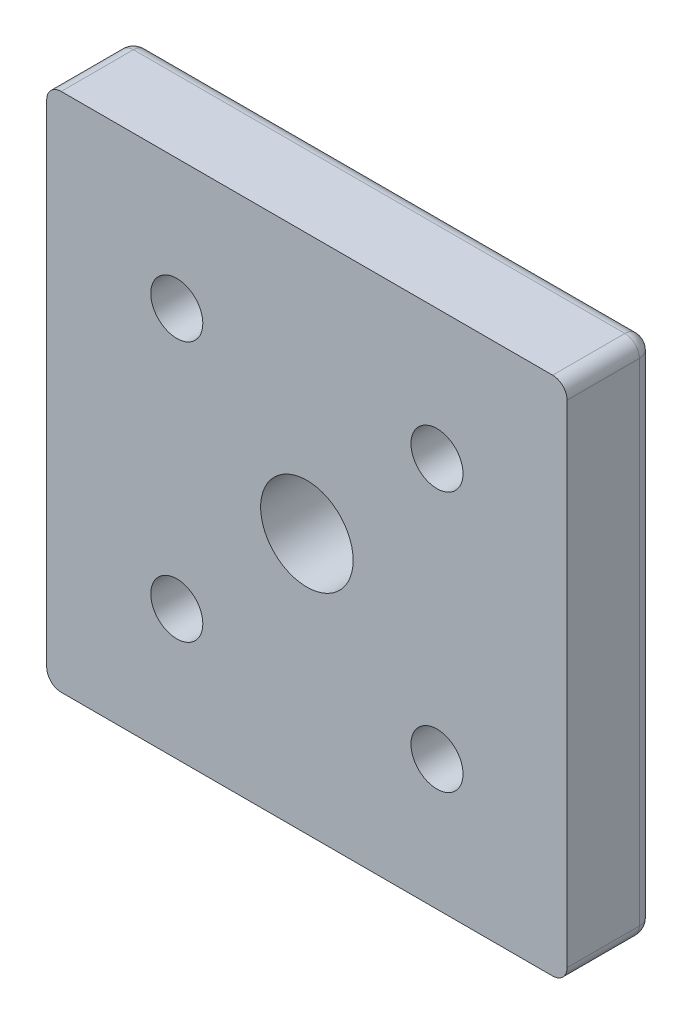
ISO-10303-21;
HEADER;
FILE_DESCRIPTION(('STEP AP214'),'2;1');
FILE_NAME('part.step','',(''),(''),'','','');
FILE_SCHEMA(('AUTOMOTIVE_DESIGN { 1 0 10303 214 1 1 1 1 }'));
ENDSEC;
DATA;
#1=APPLICATION_CONTEXT('core data for automotive mechanical design processes');
#2=APPLICATION_PROTOCOL_DEFINITION('international standard','automotive_design',2000,#1);
#3=PRODUCT_CONTEXT('',#1,'mechanical');
#4=PRODUCT('Part','Part','',(#3));
#5=PRODUCT_RELATED_PRODUCT_CATEGORY('part','',(#4));
#6=PRODUCT_DEFINITION_FORMATION('','',#4);
#7=PRODUCT_DEFINITION_CONTEXT('part definition',#1,'design');
#8=PRODUCT_DEFINITION('design','',#6,#7);
#9=PRODUCT_DEFINITION_SHAPE('','',#8);
#10=(LENGTH_UNIT() NAMED_UNIT(*) SI_UNIT(.MILLI.,.METRE.));
#11=(NAMED_UNIT(*) PLANE_ANGLE_UNIT() SI_UNIT($,.RADIAN.));
#12=(NAMED_UNIT(*) SI_UNIT($,.STERADIAN.) SOLID_ANGLE_UNIT());
#13=UNCERTAINTY_MEASURE_WITH_UNIT(LENGTH_MEASURE(1.E-05),#10,'distance_accuracy_value','');
#14=(GEOMETRIC_REPRESENTATION_CONTEXT(3) GLOBAL_UNCERTAINTY_ASSIGNED_CONTEXT((#13)) GLOBAL_UNIT_ASSIGNED_CONTEXT((#10,
#11,#12)) REPRESENTATION_CONTEXT('',''));
#15=CARTESIAN_POINT('',(0.,0.,0.));
#16=DIRECTION('',(0.,0.,1.));
#17=DIRECTION('',(1.,0.,0.));
#18=AXIS2_PLACEMENT_3D('',#15,#16,#17);
#19=CARTESIAN_POINT('',(22.5,-22.5,0.));
#20=DIRECTION('',(0.,0.,1.));
#21=DIRECTION('',(1.,0.,0.));
#22=AXIS2_PLACEMENT_3D('',#19,#20,#21);
#23=CYLINDRICAL_SURFACE('',#22,7.5);
#24=CARTESIAN_POINT('',(22.5,-22.5,5.5));
#25=DIRECTION('',(0.,0.,1.));
#26=DIRECTION('',(1.,0.,0.));
#27=AXIS2_PLACEMENT_3D('',#24,#25,#26);
#28=CIRCLE('',#27,7.5);
#29=CARTESIAN_POINT('',(30.,-22.5,5.5));
#30=VERTEX_POINT('',#29);
#31=EDGE_CURVE('E254',#30,#30,#28,.T.);
#32=ORIENTED_EDGE('',*,*,#31,.T.);
#33=EDGE_LOOP('',(#32));
#34=FACE_BOUND('',#33,.T.);
#35=CARTESIAN_POINT('',(22.5,-22.5,0.));
#36=DIRECTION('',(0.,0.,1.));
#37=DIRECTION('',(1.,0.,0.));
#38=AXIS2_PLACEMENT_3D('',#35,#36,#37);
#39=CIRCLE('',#38,7.5);
#40=CARTESIAN_POINT('',(30.,-22.5,0.));
#41=VERTEX_POINT('',#40);
#42=EDGE_CURVE('E19',#41,#41,#39,.F.);
#43=ORIENTED_EDGE('',*,*,#42,.T.);
#44=EDGE_LOOP('',(#43));
#45=FACE_BOUND('',#44,.T.);
#46=ADVANCED_FACE('F15',(#34,#45),#23,.F.);
#47=CARTESIAN_POINT('',(-22.5,-22.5,0.));
#48=DIRECTION('',(0.,0.,1.));
#49=DIRECTION('',(1.,0.,0.));
#50=AXIS2_PLACEMENT_3D('',#47,#48,#49);
#51=CYLINDRICAL_SURFACE('',#50,7.5);
#52=CARTESIAN_POINT('',(-22.5,-22.5,5.5));
#53=DIRECTION('',(0.,0.,1.));
#54=DIRECTION('',(1.,0.,0.));
#55=AXIS2_PLACEMENT_3D('',#52,#53,#54);
#56=CIRCLE('',#55,7.5);
#57=CARTESIAN_POINT('',(-15.,-22.5,5.5));
#58=VERTEX_POINT('',#57);
#59=EDGE_CURVE('E251',#58,#58,#56,.T.);
#60=ORIENTED_EDGE('',*,*,#59,.T.);
#61=EDGE_LOOP('',(#60));
#62=FACE_BOUND('',#61,.T.);
#63=CARTESIAN_POINT('',(-22.5,-22.5,0.));
#64=DIRECTION('',(0.,0.,1.));
#65=DIRECTION('',(1.,0.,0.));
#66=AXIS2_PLACEMENT_3D('',#63,#64,#65);
#67=CIRCLE('',#66,7.5);
#68=CARTESIAN_POINT('',(-15.,-22.5,0.));
#69=VERTEX_POINT('',#68);
#70=EDGE_CURVE('E260',#69,#69,#67,.F.);
#71=ORIENTED_EDGE('',*,*,#70,.T.);
#72=EDGE_LOOP('',(#71));
#73=FACE_BOUND('',#72,.T.);
#74=ADVANCED_FACE('F362',(#62,#73),#51,.F.);
#75=CARTESIAN_POINT('',(22.5,22.5,0.));
#76=DIRECTION('',(0.,0.,1.));
#77=DIRECTION('',(1.,0.,0.));
#78=AXIS2_PLACEMENT_3D('',#75,#76,#77);
#79=CYLINDRICAL_SURFACE('',#78,7.5);
#80=CARTESIAN_POINT('',(22.5,22.5,5.5));
#81=DIRECTION('',(0.,0.,1.));
#82=DIRECTION('',(1.,0.,0.));
#83=AXIS2_PLACEMENT_3D('',#80,#81,#82);
#84=CIRCLE('',#83,7.5);
#85=CARTESIAN_POINT('',(30.,22.5,5.5));
#86=VERTEX_POINT('',#85);
#87=EDGE_CURVE('E248',#86,#86,#84,.T.);
#88=ORIENTED_EDGE('',*,*,#87,.T.);
#89=EDGE_LOOP('',(#88));
#90=FACE_BOUND('',#89,.T.);
#91=CARTESIAN_POINT('',(22.5,22.5,0.));
#92=DIRECTION('',(0.,0.,1.));
#93=DIRECTION('',(1.,0.,0.));
#94=AXIS2_PLACEMENT_3D('',#91,#92,#93);
#95=CIRCLE('',#94,7.5);
#96=CARTESIAN_POINT('',(30.,22.5,0.));
#97=VERTEX_POINT('',#96);
#98=EDGE_CURVE('E262',#97,#97,#95,.F.);
#99=ORIENTED_EDGE('',*,*,#98,.T.);
#100=EDGE_LOOP('',(#99));
#101=FACE_BOUND('',#100,.T.);
#102=ADVANCED_FACE('F366',(#90,#101),#79,.F.);
#103=CARTESIAN_POINT('',(-22.5,22.5,0.));
#104=DIRECTION('',(0.,0.,1.));
#105=DIRECTION('',(1.,0.,0.));
#106=AXIS2_PLACEMENT_3D('',#103,#104,#105);
#107=CYLINDRICAL_SURFACE('',#106,7.5);
#108=CARTESIAN_POINT('',(-22.5,22.5,5.5));
#109=DIRECTION('',(0.,0.,1.));
#110=DIRECTION('',(1.,0.,0.));
#111=AXIS2_PLACEMENT_3D('',#108,#109,#110);
#112=CIRCLE('',#111,7.5);
#113=CARTESIAN_POINT('',(-15.,22.5,5.5));
#114=VERTEX_POINT('',#113);
#115=EDGE_CURVE('E121',#114,#114,#112,.T.);
#116=ORIENTED_EDGE('',*,*,#115,.T.);
#117=EDGE_LOOP('',(#116));
#118=FACE_BOUND('',#117,.T.);
#119=CARTESIAN_POINT('',(-22.5,22.5,0.));
#120=DIRECTION('',(0.,0.,1.));
#121=DIRECTION('',(1.,0.,0.));
#122=AXIS2_PLACEMENT_3D('',#119,#120,#121);
#123=CIRCLE('',#122,7.5);
#124=CARTESIAN_POINT('',(-15.,22.5,0.));
#125=VERTEX_POINT('',#124);
#126=EDGE_CURVE('E257',#125,#125,#123,.F.);
#127=ORIENTED_EDGE('',*,*,#126,.T.);
#128=EDGE_LOOP('',(#127));
#129=FACE_BOUND('',#128,.T.);
#130=ADVANCED_FACE('F194',(#118,#129),#107,.F.);
#131=CARTESIAN_POINT('',(42.5,42.5,2.5));
#132=DIRECTION('',(1.,0.,0.));
#133=DIRECTION('',(0.,1.,0.));
#134=AXIS2_PLACEMENT_3D('',#131,#132,#133);
#135=SPHERICAL_SURFACE('',#134,2.5);
#136=CARTESIAN_POINT('',(42.5,42.5,2.5));
#137=DIRECTION('',(0.,0.,1.));
#138=DIRECTION('',(1.,0.,0.));
#139=AXIS2_PLACEMENT_3D('',#136,#137,#138);
#140=CIRCLE('',#139,2.5);
#141=CARTESIAN_POINT('',(45.,42.5,2.5));
#142=VERTEX_POINT('',#141);
#143=CARTESIAN_POINT('',(42.5,45.,2.5));
#144=VERTEX_POINT('',#143);
#145=EDGE_CURVE('E67',#142,#144,#140,.T.);
#146=ORIENTED_EDGE('',*,*,#145,.F.);
#147=CARTESIAN_POINT('',(42.5,42.5,2.5));
#148=DIRECTION('',(0.,1.,0.));
#149=DIRECTION('',(0.,0.,1.));
#150=AXIS2_PLACEMENT_3D('',#147,#148,#149);
#151=CIRCLE('',#150,2.5);
#152=CARTESIAN_POINT('',(42.5,42.5000000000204,0.));
#153=VERTEX_POINT('',#152);
#154=EDGE_CURVE('E102',#153,#142,#151,.F.);
#155=ORIENTED_EDGE('',*,*,#154,.F.);
#156=CARTESIAN_POINT('',(42.5,42.5,2.5));
#157=DIRECTION('',(-1.,0.,0.));
#158=DIRECTION('',(0.,0.,1.));
#159=AXIS2_PLACEMENT_3D('',#156,#157,#158);
#160=CIRCLE('',#159,2.5);
#161=EDGE_CURVE('E99',#144,#153,#160,.T.);
#162=ORIENTED_EDGE('',*,*,#161,.F.);
#163=EDGE_LOOP('',(#146,#155,#162));
#164=FACE_BOUND('',#163,.T.);
#165=ADVANCED_FACE('F101',(#164),#135,.T.);
#166=CARTESIAN_POINT('',(-22.5,42.5,2.5));
#167=DIRECTION('',(-1.,0.,0.));
#168=DIRECTION('',(0.,0.,1.));
#169=AXIS2_PLACEMENT_3D('',#166,#167,#168);
#170=CYLINDRICAL_SURFACE('',#169,2.5);
#171=CARTESIAN_POINT('',(-42.5,42.5,2.5));
#172=DIRECTION('',(1.,0.,0.));
#173=DIRECTION('',(0.,1.,0.));
#174=AXIS2_PLACEMENT_3D('',#171,#172,#173);
#175=CIRCLE('',#174,2.5);
#176=CARTESIAN_POINT('',(-42.5,45.,2.5));
#177=VERTEX_POINT('',#176);
#178=CARTESIAN_POINT('',(-42.5,42.5,0.));
#179=VERTEX_POINT('',#178);
#180=EDGE_CURVE('E106',#177,#179,#175,.F.);
#181=ORIENTED_EDGE('',*,*,#180,.F.);
#182=DIRECTION('',(1.,0.,0.));
#183=VECTOR('',#182,1.);
#184=CARTESIAN_POINT('',(-45.,45.,2.5));
#185=LINE('',#184,#183);
#186=EDGE_CURVE('E109',#144,#177,#185,.F.);
#187=ORIENTED_EDGE('',*,*,#186,.F.);
#188=ORIENTED_EDGE('',*,*,#161,.T.);
#189=DIRECTION('',(1.,0.,0.));
#190=VECTOR('',#189,1.);
#191=CARTESIAN_POINT('',(0.,42.5,0.));
#192=LINE('',#191,#190);
#193=EDGE_CURVE('E145',#153,#179,#192,.F.);
#194=ORIENTED_EDGE('',*,*,#193,.T.);
#195=EDGE_LOOP('',(#181,#187,#188,#194));
#196=FACE_BOUND('',#195,.T.);
#197=ADVANCED_FACE('F110',(#196),#170,.T.);
#198=CARTESIAN_POINT('',(-42.5,42.5,2.5));
#199=DIRECTION('',(1.,0.,0.));
#200=DIRECTION('',(0.,1.,0.));
#201=AXIS2_PLACEMENT_3D('',#198,#199,#200);
#202=SPHERICAL_SURFACE('',#201,2.5);
#203=CARTESIAN_POINT('',(-42.5,42.5,2.5));
#204=DIRECTION('',(0.,0.,1.));
#205=DIRECTION('',(1.,0.,0.));
#206=AXIS2_PLACEMENT_3D('',#203,#204,#205);
#207=CIRCLE('',#206,2.5);
#208=CARTESIAN_POINT('',(-45.,42.5,2.5));
#209=VERTEX_POINT('',#208);
#210=EDGE_CURVE('E126',#177,#209,#207,.T.);
#211=ORIENTED_EDGE('',*,*,#210,.F.);
#212=ORIENTED_EDGE('',*,*,#180,.T.);
#213=CARTESIAN_POINT('',(-42.5,42.5,2.5));
#214=DIRECTION('',(0.,-1.,0.));
#215=DIRECTION('',(0.,0.,-1.));
#216=AXIS2_PLACEMENT_3D('',#213,#214,#215);
#217=CIRCLE('',#216,2.5);
#218=EDGE_CURVE('E179',#209,#179,#217,.T.);
#219=ORIENTED_EDGE('',*,*,#218,.F.);
#220=EDGE_LOOP('',(#211,#212,#219));
#221=FACE_BOUND('',#220,.T.);
#222=ADVANCED_FACE('F185',(#221),#202,.T.);
#223=CARTESIAN_POINT('',(-42.5,-22.5,2.5));
#224=DIRECTION('',(0.,-1.,0.));
#225=DIRECTION('',(0.,0.,-1.));
#226=AXIS2_PLACEMENT_3D('',#223,#224,#225);
#227=CYLINDRICAL_SURFACE('',#226,2.5);
#228=CARTESIAN_POINT('',(-42.5,-42.5,2.5));
#229=DIRECTION('',(0.,1.,-9.81305763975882E-11));
#230=DIRECTION('',(1.,0.,0.));
#231=AXIS2_PLACEMENT_3D('',#228,#229,#230);
#232=CIRCLE('',#231,2.5);
#233=CARTESIAN_POINT('',(-45.,-42.5,2.5));
#234=VERTEX_POINT('',#233);
#235=CARTESIAN_POINT('',(-42.5,-42.5000000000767,0.));
#236=VERTEX_POINT('',#235);
#237=EDGE_CURVE('E177',#234,#236,#232,.F.);
#238=ORIENTED_EDGE('',*,*,#237,.F.);
#239=DIRECTION('',(0.,1.,0.));
#240=VECTOR('',#239,1.);
#241=CARTESIAN_POINT('',(-45.,-45.,2.5));
#242=LINE('',#241,#240);
#243=EDGE_CURVE('E175',#209,#234,#242,.F.);
#244=ORIENTED_EDGE('',*,*,#243,.F.);
#245=ORIENTED_EDGE('',*,*,#218,.T.);
#246=DIRECTION('',(0.,1.,0.));
#247=VECTOR('',#246,1.);
#248=CARTESIAN_POINT('',(-42.5,0.,0.));
#249=LINE('',#248,#247);
#250=EDGE_CURVE('E202',#179,#236,#249,.F.);
#251=ORIENTED_EDGE('',*,*,#250,.T.);
#252=EDGE_LOOP('',(#238,#244,#245,#251));
#253=FACE_BOUND('',#252,.T.);
#254=ADVANCED_FACE('F169',(#253),#227,.T.);
#255=CARTESIAN_POINT('',(-42.5,-42.5,2.5));
#256=DIRECTION('',(1.,0.,0.));
#257=DIRECTION('',(0.,1.,0.));
#258=AXIS2_PLACEMENT_3D('',#255,#256,#257);
#259=SPHERICAL_SURFACE('',#258,2.5);
#260=CARTESIAN_POINT('',(-42.5,-42.5,2.5));
#261=DIRECTION('',(0.,0.,1.));
#262=DIRECTION('',(1.,0.,0.));
#263=AXIS2_PLACEMENT_3D('',#260,#261,#262);
#264=CIRCLE('',#263,2.5);
#265=CARTESIAN_POINT('',(-42.5,-45.,2.5));
#266=VERTEX_POINT('',#265);
#267=EDGE_CURVE('E286',#234,#266,#264,.T.);
#268=ORIENTED_EDGE('',*,*,#267,.F.);
#269=ORIENTED_EDGE('',*,*,#237,.T.);
#270=CARTESIAN_POINT('',(-42.5,-42.5,2.5));
#271=DIRECTION('',(1.,0.,0.));
#272=DIRECTION('',(0.,0.,-1.));
#273=AXIS2_PLACEMENT_3D('',#270,#271,#272);
#274=CIRCLE('',#273,2.5);
#275=EDGE_CURVE('E178',#266,#236,#274,.T.);
#276=ORIENTED_EDGE('',*,*,#275,.F.);
#277=EDGE_LOOP('',(#268,#269,#276));
#278=FACE_BOUND('',#277,.T.);
#279=ADVANCED_FACE('F164',(#278),#259,.T.);
#280=CARTESIAN_POINT('',(22.5,-42.5,2.5));
#281=DIRECTION('',(1.,0.,0.));
#282=DIRECTION('',(0.,0.,-1.));
#283=AXIS2_PLACEMENT_3D('',#280,#281,#282);
#284=CYLINDRICAL_SURFACE('',#283,2.5);
#285=CARTESIAN_POINT('',(42.5,-42.5,2.5));
#286=DIRECTION('',(1.,0.,0.));
#287=DIRECTION('',(0.,1.,0.));
#288=AXIS2_PLACEMENT_3D('',#285,#286,#287);
#289=CIRCLE('',#288,2.5);
#290=CARTESIAN_POINT('',(42.5,-45.,2.50000000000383));
#291=VERTEX_POINT('',#290);
#292=CARTESIAN_POINT('',(42.5,-42.5,0.));
#293=VERTEX_POINT('',#292);
#294=EDGE_CURVE('E143',#291,#293,#289,.T.);
#295=ORIENTED_EDGE('',*,*,#294,.F.);
#296=DIRECTION('',(1.,0.,0.));
#297=VECTOR('',#296,1.);
#298=CARTESIAN_POINT('',(45.,-45.,2.5));
#299=LINE('',#298,#297);
#300=EDGE_CURVE('E146',#266,#291,#299,.T.);
#301=ORIENTED_EDGE('',*,*,#300,.F.);
#302=ORIENTED_EDGE('',*,*,#275,.T.);
#303=DIRECTION('',(1.,0.,0.));
#304=VECTOR('',#303,1.);
#305=CARTESIAN_POINT('',(0.,-42.5,0.));
#306=LINE('',#305,#304);
#307=EDGE_CURVE('E200',#236,#293,#306,.T.);
#308=ORIENTED_EDGE('',*,*,#307,.T.);
#309=EDGE_LOOP('',(#295,#301,#302,#308));
#310=FACE_BOUND('',#309,.T.);
#311=ADVANCED_FACE('F159',(#310),#284,.T.);
#312=CARTESIAN_POINT('',(42.5,-42.5,2.5));
#313=DIRECTION('',(1.,0.,0.));
#314=DIRECTION('',(0.,1.,0.));
#315=AXIS2_PLACEMENT_3D('',#312,#313,#314);
#316=SPHERICAL_SURFACE('',#315,2.5);
#317=CARTESIAN_POINT('',(42.5,-42.5,2.5));
#318=DIRECTION('',(0.,0.,1.));
#319=DIRECTION('',(1.,0.,0.));
#320=AXIS2_PLACEMENT_3D('',#317,#318,#319);
#321=CIRCLE('',#320,2.5);
#322=CARTESIAN_POINT('',(45.,-42.5,2.5));
#323=VERTEX_POINT('',#322);
#324=EDGE_CURVE('E134',#291,#323,#321,.T.);
#325=ORIENTED_EDGE('',*,*,#324,.F.);
#326=ORIENTED_EDGE('',*,*,#294,.T.);
#327=CARTESIAN_POINT('',(42.5,-42.5,2.5));
#328=DIRECTION('',(0.,1.,0.));
#329=DIRECTION('',(0.,0.,1.));
#330=AXIS2_PLACEMENT_3D('',#327,#328,#329);
#331=CIRCLE('',#330,2.5);
#332=EDGE_CURVE('E140',#323,#293,#331,.T.);
#333=ORIENTED_EDGE('',*,*,#332,.F.);
#334=EDGE_LOOP('',(#325,#326,#333));
#335=FACE_BOUND('',#334,.T.);
#336=ADVANCED_FACE('F154',(#335),#316,.T.);
#337=CARTESIAN_POINT('',(42.5,22.5,2.5));
#338=DIRECTION('',(0.,1.,0.));
#339=DIRECTION('',(0.,0.,1.));
#340=AXIS2_PLACEMENT_3D('',#337,#338,#339);
#341=CYLINDRICAL_SURFACE('',#340,2.5);
#342=ORIENTED_EDGE('',*,*,#154,.T.);
#343=DIRECTION('',(0.,1.,0.));
#344=VECTOR('',#343,1.);
#345=CARTESIAN_POINT('',(45.,45.,2.5));
#346=LINE('',#345,#344);
#347=EDGE_CURVE('E138',#323,#142,#346,.T.);
#348=ORIENTED_EDGE('',*,*,#347,.F.);
#349=ORIENTED_EDGE('',*,*,#332,.T.);
#350=DIRECTION('',(0.,1.,0.));
#351=VECTOR('',#350,1.);
#352=CARTESIAN_POINT('',(42.5,0.,0.));
#353=LINE('',#352,#351);
#354=EDGE_CURVE('E198',#293,#153,#353,.T.);
#355=ORIENTED_EDGE('',*,*,#354,.T.);
#356=EDGE_LOOP('',(#342,#348,#349,#355));
#357=FACE_BOUND('',#356,.T.);
#358=ADVANCED_FACE('F158',(#357),#341,.T.);
#359=CARTESIAN_POINT('',(0.,0.,0.));
#360=DIRECTION('',(0.,0.,1.));
#361=DIRECTION('',(1.,0.,0.));
#362=AXIS2_PLACEMENT_3D('',#359,#360,#361);
#363=PLANE('',#362);
#364=ORIENTED_EDGE('',*,*,#126,.F.);
#365=EDGE_LOOP('',(#364));
#366=FACE_BOUND('',#365,.T.);
#367=ORIENTED_EDGE('',*,*,#70,.F.);
#368=EDGE_LOOP('',(#367));
#369=FACE_BOUND('',#368,.T.);
#370=ORIENTED_EDGE('',*,*,#98,.F.);
#371=EDGE_LOOP('',(#370));
#372=FACE_BOUND('',#371,.T.);
#373=ORIENTED_EDGE('',*,*,#42,.F.);
#374=EDGE_LOOP('',(#373));
#375=FACE_BOUND('',#374,.T.);
#376=CARTESIAN_POINT('',(0.,0.,0.));
#377=DIRECTION('',(0.,0.,1.));
#378=DIRECTION('',(1.,0.,0.));
#379=AXIS2_PLACEMENT_3D('',#376,#377,#378);
#380=CIRCLE('',#379,8.);
#381=CARTESIAN_POINT('',(8.,0.,0.));
#382=VERTEX_POINT('',#381);
#383=EDGE_CURVE('E243',#382,#382,#380,.T.);
#384=ORIENTED_EDGE('',*,*,#383,.T.);
#385=EDGE_LOOP('',(#384));
#386=FACE_BOUND('',#385,.T.);
#387=ORIENTED_EDGE('',*,*,#307,.F.);
#388=ORIENTED_EDGE('',*,*,#250,.F.);
#389=ORIENTED_EDGE('',*,*,#193,.F.);
#390=ORIENTED_EDGE('',*,*,#354,.F.);
#391=EDGE_LOOP('',(#387,#388,#389,#390));
#392=FACE_BOUND('',#391,.T.);
#393=ADVANCED_FACE('F270',(#366,#369,#372,#375,#386,#392),#363,.F.);
#394=CARTESIAN_POINT('',(30.15,-14.85,5.5));
#395=DIRECTION('',(0.,0.,1.));
#396=DIRECTION('',(-1.,0.,0.));
#397=AXIS2_PLACEMENT_3D('',#394,#395,#396);
#398=PLANE('',#397);
#399=CARTESIAN_POINT('',(22.5,-22.5,5.5));
#400=DIRECTION('',(0.,0.,1.));
#401=DIRECTION('',(1.,0.,0.));
#402=AXIS2_PLACEMENT_3D('',#399,#400,#401);
#403=CIRCLE('',#402,4.5);
#404=CARTESIAN_POINT('',(27.,-22.5,5.5));
#405=VERTEX_POINT('',#404);
#406=EDGE_CURVE('E240',#405,#405,#403,.T.);
#407=ORIENTED_EDGE('',*,*,#406,.T.);
#408=EDGE_LOOP('',(#407));
#409=FACE_BOUND('',#408,.T.);
#410=ORIENTED_EDGE('',*,*,#31,.F.);
#411=EDGE_LOOP('',(#410));
#412=FACE_BOUND('',#411,.T.);
#413=ADVANCED_FACE('F273',(#409,#412),#398,.F.);
#414=CARTESIAN_POINT('',(-14.85,-14.85,5.5));
#415=DIRECTION('',(0.,0.,1.));
#416=DIRECTION('',(-1.,0.,0.));
#417=AXIS2_PLACEMENT_3D('',#414,#415,#416);
#418=PLANE('',#417);
#419=CARTESIAN_POINT('',(-22.5,-22.5,5.5));
#420=DIRECTION('',(0.,0.,1.));
#421=DIRECTION('',(1.,0.,0.));
#422=AXIS2_PLACEMENT_3D('',#419,#420,#421);
#423=CIRCLE('',#422,4.5);
#424=CARTESIAN_POINT('',(-18.,-22.5,5.5));
#425=VERTEX_POINT('',#424);
#426=EDGE_CURVE('E237',#425,#425,#423,.T.);
#427=ORIENTED_EDGE('',*,*,#426,.T.);
#428=EDGE_LOOP('',(#427));
#429=FACE_BOUND('',#428,.T.);
#430=ORIENTED_EDGE('',*,*,#59,.F.);
#431=EDGE_LOOP('',(#430));
#432=FACE_BOUND('',#431,.T.);
#433=ADVANCED_FACE('F357',(#429,#432),#418,.F.);
#434=CARTESIAN_POINT('',(30.15,30.15,5.5));
#435=DIRECTION('',(0.,0.,1.));
#436=DIRECTION('',(-1.,0.,0.));
#437=AXIS2_PLACEMENT_3D('',#434,#435,#436);
#438=PLANE('',#437);
#439=CARTESIAN_POINT('',(22.5,22.5,5.5));
#440=DIRECTION('',(0.,0.,1.));
#441=DIRECTION('',(1.,0.,0.));
#442=AXIS2_PLACEMENT_3D('',#439,#440,#441);
#443=CIRCLE('',#442,4.5);
#444=CARTESIAN_POINT('',(27.,22.5,5.5));
#445=VERTEX_POINT('',#444);
#446=EDGE_CURVE('E234',#445,#445,#443,.T.);
#447=ORIENTED_EDGE('',*,*,#446,.T.);
#448=EDGE_LOOP('',(#447));
#449=FACE_BOUND('',#448,.T.);
#450=ORIENTED_EDGE('',*,*,#87,.F.);
#451=EDGE_LOOP('',(#450));
#452=FACE_BOUND('',#451,.T.);
#453=ADVANCED_FACE('F379',(#449,#452),#438,.F.);
#454=CARTESIAN_POINT('',(-14.85,30.15,5.5));
#455=DIRECTION('',(0.,0.,1.));
#456=DIRECTION('',(-1.,0.,0.));
#457=AXIS2_PLACEMENT_3D('',#454,#455,#456);
#458=PLANE('',#457);
#459=CARTESIAN_POINT('',(-22.5,22.5,5.5));
#460=DIRECTION('',(0.,0.,1.));
#461=DIRECTION('',(1.,0.,0.));
#462=AXIS2_PLACEMENT_3D('',#459,#460,#461);
#463=CIRCLE('',#462,4.5);
#464=CARTESIAN_POINT('',(-18.,22.5,5.5));
#465=VERTEX_POINT('',#464);
#466=EDGE_CURVE('E231',#465,#465,#463,.T.);
#467=ORIENTED_EDGE('',*,*,#466,.T.);
#468=EDGE_LOOP('',(#467));
#469=FACE_BOUND('',#468,.T.);
#470=ORIENTED_EDGE('',*,*,#115,.F.);
#471=EDGE_LOOP('',(#470));
#472=FACE_BOUND('',#471,.T.);
#473=ADVANCED_FACE('F17',(#469,#472),#458,.F.);
#474=CARTESIAN_POINT('',(42.5,42.5,0.));
#475=DIRECTION('',(0.,0.,1.));
#476=DIRECTION('',(1.,0.,0.));
#477=AXIS2_PLACEMENT_3D('',#474,#475,#476);
#478=CYLINDRICAL_SURFACE('',#477,2.5);
#479=CARTESIAN_POINT('',(42.5,42.5,15.));
#480=DIRECTION('',(0.,0.,1.));
#481=DIRECTION('',(1.,0.,0.));
#482=AXIS2_PLACEMENT_3D('',#479,#480,#481);
#483=CIRCLE('',#482,2.5);
#484=CARTESIAN_POINT('',(45.,42.5,15.));
#485=VERTEX_POINT('',#484);
#486=CARTESIAN_POINT('',(42.5,45.,15.));
#487=VERTEX_POINT('',#486);
#488=EDGE_CURVE('E58',#485,#487,#483,.T.);
#489=ORIENTED_EDGE('',*,*,#488,.F.);
#490=DIRECTION('',(0.,0.,-1.));
#491=VECTOR('',#490,1.);
#492=CARTESIAN_POINT('',(45.,42.5,0.));
#493=LINE('',#492,#491);
#494=EDGE_CURVE('E119',#142,#485,#493,.F.);
#495=ORIENTED_EDGE('',*,*,#494,.F.);
#496=ORIENTED_EDGE('',*,*,#145,.T.);
#497=DIRECTION('',(0.,0.,1.));
#498=VECTOR('',#497,1.);
#499=CARTESIAN_POINT('',(42.5,45.,0.));
#500=LINE('',#499,#498);
#501=EDGE_CURVE('E115',#487,#144,#500,.F.);
#502=ORIENTED_EDGE('',*,*,#501,.F.);
#503=EDGE_LOOP('',(#489,#495,#496,#502));
#504=FACE_BOUND('',#503,.T.);
#505=ADVANCED_FACE('F117',(#504),#478,.T.);
#506=CARTESIAN_POINT('',(-45.,45.,0.));
#507=DIRECTION('',(0.,1.,0.));
#508=DIRECTION('',(0.,0.,1.));
#509=AXIS2_PLACEMENT_3D('',#506,#507,#508);
#510=PLANE('',#509);
#511=DIRECTION('',(1.,0.,0.));
#512=VECTOR('',#511,1.);
#513=CARTESIAN_POINT('',(0.,45.,15.));
#514=LINE('',#513,#512);
#515=CARTESIAN_POINT('',(-42.5,45.,15.));
#516=VERTEX_POINT('',#515);
#517=EDGE_CURVE('E125',#487,#516,#514,.F.);
#518=ORIENTED_EDGE('',*,*,#517,.F.);
#519=ORIENTED_EDGE('',*,*,#501,.T.);
#520=ORIENTED_EDGE('',*,*,#186,.T.);
#521=DIRECTION('',(0.,0.,1.));
#522=VECTOR('',#521,1.);
#523=CARTESIAN_POINT('',(-42.5,45.,0.));
#524=LINE('',#523,#522);
#525=EDGE_CURVE('E129',#516,#177,#524,.F.);
#526=ORIENTED_EDGE('',*,*,#525,.F.);
#527=EDGE_LOOP('',(#518,#519,#520,#526));
#528=FACE_BOUND('',#527,.T.);
#529=ADVANCED_FACE('F123',(#528),#510,.T.);
#530=CARTESIAN_POINT('',(-42.5,42.5,0.));
#531=DIRECTION('',(0.,0.,1.));
#532=DIRECTION('',(1.,0.,0.));
#533=AXIS2_PLACEMENT_3D('',#530,#531,#532);
#534=CYLINDRICAL_SURFACE('',#533,2.5);
#535=CARTESIAN_POINT('',(-42.5,42.5,15.));
#536=DIRECTION('',(0.,0.,1.));
#537=DIRECTION('',(1.,0.,0.));
#538=AXIS2_PLACEMENT_3D('',#535,#536,#537);
#539=CIRCLE('',#538,2.5);
#540=CARTESIAN_POINT('',(-45.,42.5,15.));
#541=VERTEX_POINT('',#540);
#542=EDGE_CURVE('E227',#516,#541,#539,.T.);
#543=ORIENTED_EDGE('',*,*,#542,.F.);
#544=ORIENTED_EDGE('',*,*,#525,.T.);
#545=ORIENTED_EDGE('',*,*,#210,.T.);
#546=DIRECTION('',(0.,0.,1.));
#547=VECTOR('',#546,1.);
#548=CARTESIAN_POINT('',(-45.,42.5,0.));
#549=LINE('',#548,#547);
#550=EDGE_CURVE('E288',#541,#209,#549,.F.);
#551=ORIENTED_EDGE('',*,*,#550,.F.);
#552=EDGE_LOOP('',(#543,#544,#545,#551));
#553=FACE_BOUND('',#552,.T.);
#554=ADVANCED_FACE('F407',(#553),#534,.T.);
#555=CARTESIAN_POINT('',(-45.,-45.,0.));
#556=DIRECTION('',(-1.,0.,0.));
#557=DIRECTION('',(0.,0.,1.));
#558=AXIS2_PLACEMENT_3D('',#555,#556,#557);
#559=PLANE('',#558);
#560=DIRECTION('',(0.,1.,0.));
#561=VECTOR('',#560,1.);
#562=CARTESIAN_POINT('',(-45.,0.,15.));
#563=LINE('',#562,#561);
#564=CARTESIAN_POINT('',(-45.,-42.5,15.));
#565=VERTEX_POINT('',#564);
#566=EDGE_CURVE('E226',#541,#565,#563,.F.);
#567=ORIENTED_EDGE('',*,*,#566,.F.);
#568=ORIENTED_EDGE('',*,*,#550,.T.);
#569=ORIENTED_EDGE('',*,*,#243,.T.);
#570=DIRECTION('',(0.,0.,1.));
#571=VECTOR('',#570,1.);
#572=CARTESIAN_POINT('',(-45.,-42.5,0.));
#573=LINE('',#572,#571);
#574=EDGE_CURVE('E149',#565,#234,#573,.F.);
#575=ORIENTED_EDGE('',*,*,#574,.F.);
#576=EDGE_LOOP('',(#567,#568,#569,#575));
#577=FACE_BOUND('',#576,.T.);
#578=ADVANCED_FACE('F412',(#577),#559,.T.);
#579=CARTESIAN_POINT('',(-42.5,-42.5,0.));
#580=DIRECTION('',(0.,0.,1.));
#581=DIRECTION('',(1.,0.,0.));
#582=AXIS2_PLACEMENT_3D('',#579,#580,#581);
#583=CYLINDRICAL_SURFACE('',#582,2.5);
#584=CARTESIAN_POINT('',(-42.5,-42.5,15.));
#585=DIRECTION('',(0.,0.,1.));
#586=DIRECTION('',(1.,0.,0.));
#587=AXIS2_PLACEMENT_3D('',#584,#585,#586);
#588=CIRCLE('',#587,2.5);
#589=CARTESIAN_POINT('',(-42.5,-45.,15.));
#590=VERTEX_POINT('',#589);
#591=EDGE_CURVE('E223',#565,#590,#588,.T.);
#592=ORIENTED_EDGE('',*,*,#591,.F.);
#593=ORIENTED_EDGE('',*,*,#574,.T.);
#594=ORIENTED_EDGE('',*,*,#267,.T.);
#595=DIRECTION('',(0.,0.,-1.));
#596=VECTOR('',#595,1.);
#597=CARTESIAN_POINT('',(-42.5,-45.,0.));
#598=LINE('',#597,#596);
#599=EDGE_CURVE('E137',#590,#266,#598,.T.);
#600=ORIENTED_EDGE('',*,*,#599,.F.);
#601=EDGE_LOOP('',(#592,#593,#594,#600));
#602=FACE_BOUND('',#601,.T.);
#603=ADVANCED_FACE('F416',(#602),#583,.T.);
#604=CARTESIAN_POINT('',(45.,-45.,0.));
#605=DIRECTION('',(0.,-1.,0.));
#606=DIRECTION('',(0.,0.,-1.));
#607=AXIS2_PLACEMENT_3D('',#604,#605,#606);
#608=PLANE('',#607);
#609=DIRECTION('',(1.,0.,0.));
#610=VECTOR('',#609,1.);
#611=CARTESIAN_POINT('',(0.,-45.,15.));
#612=LINE('',#611,#610);
#613=CARTESIAN_POINT('',(42.5,-45.,15.));
#614=VERTEX_POINT('',#613);
#615=EDGE_CURVE('E222',#590,#614,#612,.T.);
#616=ORIENTED_EDGE('',*,*,#615,.F.);
#617=ORIENTED_EDGE('',*,*,#599,.T.);
#618=ORIENTED_EDGE('',*,*,#300,.T.);
#619=DIRECTION('',(0.,0.,1.));
#620=VECTOR('',#619,1.);
#621=CARTESIAN_POINT('',(42.5,-45.,0.));
#622=LINE('',#621,#620);
#623=EDGE_CURVE('E136',#614,#291,#622,.F.);
#624=ORIENTED_EDGE('',*,*,#623,.F.);
#625=EDGE_LOOP('',(#616,#617,#618,#624));
#626=FACE_BOUND('',#625,.T.);
#627=ADVANCED_FACE('F326',(#626),#608,.T.);
#628=CARTESIAN_POINT('',(42.5,-42.5,0.));
#629=DIRECTION('',(0.,0.,1.));
#630=DIRECTION('',(1.,0.,0.));
#631=AXIS2_PLACEMENT_3D('',#628,#629,#630);
#632=CYLINDRICAL_SURFACE('',#631,2.5);
#633=CARTESIAN_POINT('',(42.5,-42.5,15.));
#634=DIRECTION('',(0.,0.,1.));
#635=DIRECTION('',(1.,0.,0.));
#636=AXIS2_PLACEMENT_3D('',#633,#634,#635);
#637=CIRCLE('',#636,2.5);
#638=CARTESIAN_POINT('',(45.,-42.5,15.));
#639=VERTEX_POINT('',#638);
#640=EDGE_CURVE('E219',#614,#639,#637,.T.);
#641=ORIENTED_EDGE('',*,*,#640,.F.);
#642=ORIENTED_EDGE('',*,*,#623,.T.);
#643=ORIENTED_EDGE('',*,*,#324,.T.);
#644=DIRECTION('',(0.,0.,-1.));
#645=VECTOR('',#644,1.);
#646=CARTESIAN_POINT('',(45.,-42.5,0.));
#647=LINE('',#646,#645);
#648=EDGE_CURVE('E34',#639,#323,#647,.T.);
#649=ORIENTED_EDGE('',*,*,#648,.F.);
#650=EDGE_LOOP('',(#641,#642,#643,#649));
#651=FACE_BOUND('',#650,.T.);
#652=ADVANCED_FACE('F316',(#651),#632,.T.);
#653=CARTESIAN_POINT('',(45.,45.,0.));
#654=DIRECTION('',(1.,0.,0.));
#655=DIRECTION('',(0.,0.,-1.));
#656=AXIS2_PLACEMENT_3D('',#653,#654,#655);
#657=PLANE('',#656);
#658=DIRECTION('',(0.,1.,0.));
#659=VECTOR('',#658,1.);
#660=CARTESIAN_POINT('',(45.,0.,15.));
#661=LINE('',#660,#659);
#662=EDGE_CURVE('E218',#639,#485,#661,.T.);
#663=ORIENTED_EDGE('',*,*,#662,.F.);
#664=ORIENTED_EDGE('',*,*,#648,.T.);
#665=ORIENTED_EDGE('',*,*,#347,.T.);
#666=ORIENTED_EDGE('',*,*,#494,.T.);
#667=EDGE_LOOP('',(#663,#664,#665,#666));
#668=FACE_BOUND('',#667,.T.);
#669=ADVANCED_FACE('F313',(#668),#657,.T.);
#670=CARTESIAN_POINT('',(0.,0.,0.));
#671=DIRECTION('',(0.,0.,1.));
#672=DIRECTION('',(1.,0.,0.));
#673=AXIS2_PLACEMENT_3D('',#670,#671,#672);
#674=CYLINDRICAL_SURFACE('',#673,8.);
#675=ORIENTED_EDGE('',*,*,#383,.F.);
#676=EDGE_LOOP('',(#675));
#677=FACE_BOUND('',#676,.T.);
#678=CARTESIAN_POINT('',(0.,0.,15.));
#679=DIRECTION('',(0.,0.,1.));
#680=DIRECTION('',(1.,0.,0.));
#681=AXIS2_PLACEMENT_3D('',#678,#679,#680);
#682=CIRCLE('',#681,8.);
#683=CARTESIAN_POINT('',(8.,0.,15.));
#684=VERTEX_POINT('',#683);
#685=EDGE_CURVE('E215',#684,#684,#682,.F.);
#686=ORIENTED_EDGE('',*,*,#685,.F.);
#687=EDGE_LOOP('',(#686));
#688=FACE_BOUND('',#687,.T.);
#689=ADVANCED_FACE('F315',(#677,#688),#674,.F.);
#690=CARTESIAN_POINT('',(22.5,-22.5,0.));
#691=DIRECTION('',(0.,0.,1.));
#692=DIRECTION('',(1.,0.,0.));
#693=AXIS2_PLACEMENT_3D('',#690,#691,#692);
#694=CYLINDRICAL_SURFACE('',#693,4.5);
#695=CARTESIAN_POINT('',(22.5,-22.5,15.));
#696=DIRECTION('',(0.,0.,1.));
#697=DIRECTION('',(1.,0.,0.));
#698=AXIS2_PLACEMENT_3D('',#695,#696,#697);
#699=CIRCLE('',#698,4.5);
#700=CARTESIAN_POINT('',(27.,-22.5,15.));
#701=VERTEX_POINT('',#700);
#702=EDGE_CURVE('E212',#701,#701,#699,.F.);
#703=ORIENTED_EDGE('',*,*,#702,.F.);
#704=EDGE_LOOP('',(#703));
#705=FACE_BOUND('',#704,.T.);
#706=ORIENTED_EDGE('',*,*,#406,.F.);
#707=EDGE_LOOP('',(#706));
#708=FACE_BOUND('',#707,.T.);
#709=ADVANCED_FACE('F323',(#705,#708),#694,.F.);
#710=CARTESIAN_POINT('',(-22.5,-22.5,0.));
#711=DIRECTION('',(0.,0.,1.));
#712=DIRECTION('',(1.,0.,0.));
#713=AXIS2_PLACEMENT_3D('',#710,#711,#712);
#714=CYLINDRICAL_SURFACE('',#713,4.5);
#715=CARTESIAN_POINT('',(-22.5,-22.5,15.));
#716=DIRECTION('',(0.,0.,1.));
#717=DIRECTION('',(1.,0.,0.));
#718=AXIS2_PLACEMENT_3D('',#715,#716,#717);
#719=CIRCLE('',#718,4.5);
#720=CARTESIAN_POINT('',(-18.,-22.5,15.));
#721=VERTEX_POINT('',#720);
#722=EDGE_CURVE('E209',#721,#721,#719,.F.);
#723=ORIENTED_EDGE('',*,*,#722,.F.);
#724=EDGE_LOOP('',(#723));
#725=FACE_BOUND('',#724,.T.);
#726=ORIENTED_EDGE('',*,*,#426,.F.);
#727=EDGE_LOOP('',(#726));
#728=FACE_BOUND('',#727,.T.);
#729=ADVANCED_FACE('F342',(#725,#728),#714,.F.);
#730=CARTESIAN_POINT('',(22.5,22.5,0.));
#731=DIRECTION('',(0.,0.,1.));
#732=DIRECTION('',(1.,0.,0.));
#733=AXIS2_PLACEMENT_3D('',#730,#731,#732);
#734=CYLINDRICAL_SURFACE('',#733,4.5);
#735=CARTESIAN_POINT('',(22.5,22.5,15.));
#736=DIRECTION('',(0.,0.,1.));
#737=DIRECTION('',(1.,0.,0.));
#738=AXIS2_PLACEMENT_3D('',#735,#736,#737);
#739=CIRCLE('',#738,4.5);
#740=CARTESIAN_POINT('',(27.,22.5,15.));
#741=VERTEX_POINT('',#740);
#742=EDGE_CURVE('E25',#741,#741,#739,.F.);
#743=ORIENTED_EDGE('',*,*,#742,.F.);
#744=EDGE_LOOP('',(#743));
#745=FACE_BOUND('',#744,.T.);
#746=ORIENTED_EDGE('',*,*,#446,.F.);
#747=EDGE_LOOP('',(#746));
#748=FACE_BOUND('',#747,.T.);
#749=ADVANCED_FACE('F335',(#745,#748),#734,.F.);
#750=CARTESIAN_POINT('',(-22.5,22.5,0.));
#751=DIRECTION('',(0.,0.,1.));
#752=DIRECTION('',(1.,0.,0.));
#753=AXIS2_PLACEMENT_3D('',#750,#751,#752);
#754=CYLINDRICAL_SURFACE('',#753,4.5);
#755=CARTESIAN_POINT('',(-22.5,22.5,15.));
#756=DIRECTION('',(0.,0.,1.));
#757=DIRECTION('',(1.,0.,0.));
#758=AXIS2_PLACEMENT_3D('',#755,#756,#757);
#759=CIRCLE('',#758,4.5);
#760=CARTESIAN_POINT('',(-18.,22.5,15.));
#761=VERTEX_POINT('',#760);
#762=EDGE_CURVE('E10',#761,#761,#759,.F.);
#763=ORIENTED_EDGE('',*,*,#762,.F.);
#764=EDGE_LOOP('',(#763));
#765=FACE_BOUND('',#764,.T.);
#766=ORIENTED_EDGE('',*,*,#466,.F.);
#767=EDGE_LOOP('',(#766));
#768=FACE_BOUND('',#767,.T.);
#769=ADVANCED_FACE('F329',(#765,#768),#754,.F.);
#770=CARTESIAN_POINT('',(0.,0.,15.));
#771=DIRECTION('',(0.,0.,1.));
#772=DIRECTION('',(1.,0.,0.));
#773=AXIS2_PLACEMENT_3D('',#770,#771,#772);
#774=PLANE('',#773);
#775=ORIENTED_EDGE('',*,*,#762,.T.);
#776=EDGE_LOOP('',(#775));
#777=FACE_BOUND('',#776,.T.);
#778=ORIENTED_EDGE('',*,*,#742,.T.);
#779=EDGE_LOOP('',(#778));
#780=FACE_BOUND('',#779,.T.);
#781=ORIENTED_EDGE('',*,*,#722,.T.);
#782=EDGE_LOOP('',(#781));
#783=FACE_BOUND('',#782,.T.);
#784=ORIENTED_EDGE('',*,*,#702,.T.);
#785=EDGE_LOOP('',(#784));
#786=FACE_BOUND('',#785,.T.);
#787=ORIENTED_EDGE('',*,*,#685,.T.);
#788=EDGE_LOOP('',(#787));
#789=FACE_BOUND('',#788,.T.);
#790=ORIENTED_EDGE('',*,*,#640,.T.);
#791=ORIENTED_EDGE('',*,*,#662,.T.);
#792=ORIENTED_EDGE('',*,*,#488,.T.);
#793=ORIENTED_EDGE('',*,*,#517,.T.);
#794=ORIENTED_EDGE('',*,*,#542,.T.);
#795=ORIENTED_EDGE('',*,*,#566,.T.);
#796=ORIENTED_EDGE('',*,*,#591,.T.);
#797=ORIENTED_EDGE('',*,*,#615,.T.);
#798=EDGE_LOOP('',(#790,#791,#792,#793,#794,#795,#796,#797));
#799=FACE_BOUND('',#798,.T.);
#800=ADVANCED_FACE('F311',(#777,#780,#783,#786,#789,#799),#774,.T.);
#801=CLOSED_SHELL('',(#46,#74,#102,#130,#165,#197,#222,#254,#279,#311,#336,#358,#393,#413,#433,
#453,#473,#505,#529,#554,#578,#603,#627,#652,#669,#689,#709,#729,#749,#769,#800));
#802=MANIFOLD_SOLID_BREP('B1',#801);
#803=ADVANCED_BREP_SHAPE_REPRESENTATION('',(#18,#802),#14);
#804=SHAPE_DEFINITION_REPRESENTATION(#9,#803);
ENDSEC;
END-ISO-10303-21;
